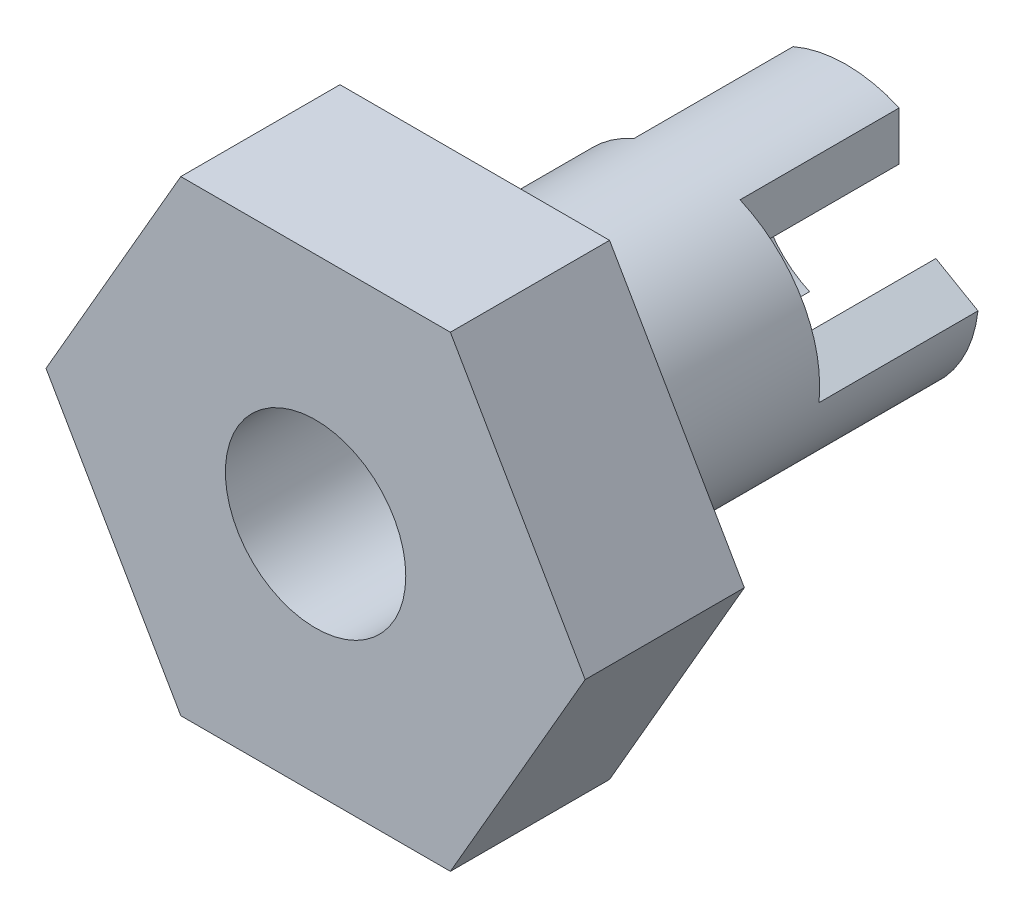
from build123d import *

# Parameters (mm, degrees)
BOSS_EXTRUDE1_DEPTH = 3.81
SKETCH3_R           = 2.159
CUT_EXTRUDE1_DEPTH  = 10.347522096
SKETCH5_R           = 3.175
SKETCH5_R_2         = 2.159
BOSS_EXTRUDE2_DEPTH = 5.08
BOSS_EXTRUDE3_DEPTH = 3.81


with BuildPart() as part:
    # Sketch1 → Boss-Extrude1 (new body)
    with BuildSketch(Plane.XY):
        Polygon((6.452466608, 0), (3.226233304, 5.588), (-3.226233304, 5.588), (-6.452466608, 0), (-3.226233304, -5.588), (3.226233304, -5.588), align=None)
    extrude(amount=BOSS_EXTRUDE1_DEPTH)

    # Sketch3 → Cut-Extrude1 (cut, through all)
    with BuildSketch(Plane.XY.offset(3.81)):
        Circle(SKETCH3_R)
    extrude(amount=-CUT_EXTRUDE1_DEPTH, mode=Mode.SUBTRACT)

    # Sketch5 → Boss-Extrude2 (add)
    with BuildSketch(Plane(origin=(0, 0, 0), x_dir=(-1, 0, 0), z_dir=(0, 0, -1))):
        with Locations(Location((0, 0, 0), (0, 0, 180))):
            Circle(SKETCH5_R)
        with Locations(Location((0, 0, 0), (0, 0, 180))):
            Circle(SKETCH5_R_2, mode=Mode.SUBTRACT)
    extrude(amount=BOSS_EXTRUDE2_DEPTH)

    # Sketch6 → Boss-Extrude3 (add)
    with BuildSketch(Plane(origin=(0, 0, -5.08), x_dir=(-1, 0, 0), z_dir=(0, 0, -1))):
        with BuildLine():
            Line((1.27, 2.909935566), (1.27, 1.74596134))
            ThreePointArc((1.27, 1.74596134), (0, 2.159), (-1.27, 1.74596134))
            Line((-1.27, 1.74596134), (-1.27, 2.909935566))
            ThreePointArc((-1.27, 2.909935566), (0, 3.175), (1.27, 2.909935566))
        make_face()
        with BuildLine():
            Line((3.155078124, -0.35511552), (2.147046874, 0.226871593))
            ThreePointArc((2.147046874, 0.226871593), (1.869748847, -1.0795), (0.877046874, -1.972832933))
            Line((0.877046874, -1.972832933), (1.885078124, -2.554820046))
            ThreePointArc((1.885078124, -2.554820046), (2.749630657, -1.5875), (3.155078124, -0.35511552))
        make_face()
        with BuildLine():
            Line((-1.885078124, -2.554820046), (-0.877046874, -1.972832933))
            ThreePointArc((-0.877046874, -1.972832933), (-1.869748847, -1.0795), (-2.147046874, 0.226871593))
            Line((-2.147046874, 0.226871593), (-3.155078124, -0.35511552))
            ThreePointArc((-3.155078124, -0.35511552), (-2.749630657, -1.5875), (-1.885078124, -2.554820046))
        make_face()
    extrude(amount=BOSS_EXTRUDE3_DEPTH)


solid = part.part
